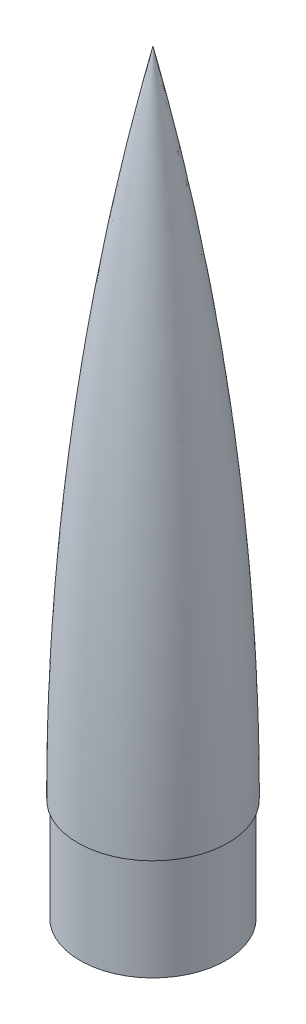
ISO-10303-21;
HEADER;
FILE_DESCRIPTION(('STEP AP214'),'2;1');
FILE_NAME('part.step','',(''),(''),'','','');
FILE_SCHEMA(('AUTOMOTIVE_DESIGN { 1 0 10303 214 1 1 1 1 }'));
ENDSEC;
DATA;
#1=APPLICATION_CONTEXT('core data for automotive mechanical design processes');
#2=APPLICATION_PROTOCOL_DEFINITION('international standard','automotive_design',2000,#1);
#3=PRODUCT_CONTEXT('',#1,'mechanical');
#4=PRODUCT('Part','Part','',(#3));
#5=PRODUCT_RELATED_PRODUCT_CATEGORY('part','',(#4));
#6=PRODUCT_DEFINITION_FORMATION('','',#4);
#7=PRODUCT_DEFINITION_CONTEXT('part definition',#1,'design');
#8=PRODUCT_DEFINITION('design','',#6,#7);
#9=PRODUCT_DEFINITION_SHAPE('','',#8);
#10=(LENGTH_UNIT() NAMED_UNIT(*) SI_UNIT(.MILLI.,.METRE.));
#11=(NAMED_UNIT(*) PLANE_ANGLE_UNIT() SI_UNIT($,.RADIAN.));
#12=(NAMED_UNIT(*) SI_UNIT($,.STERADIAN.) SOLID_ANGLE_UNIT());
#13=UNCERTAINTY_MEASURE_WITH_UNIT(LENGTH_MEASURE(1.E-05),#10,'distance_accuracy_value','');
#14=(GEOMETRIC_REPRESENTATION_CONTEXT(3) GLOBAL_UNCERTAINTY_ASSIGNED_CONTEXT((#13)) GLOBAL_UNIT_ASSIGNED_CONTEXT((#10,
#11,#12)) REPRESENTATION_CONTEXT('',''));
#15=CARTESIAN_POINT('',(0.,0.,0.));
#16=DIRECTION('',(0.,0.,1.));
#17=DIRECTION('',(1.,0.,0.));
#18=AXIS2_PLACEMENT_3D('',#15,#16,#17);
#19=CARTESIAN_POINT('',(0.,0.,0.));
#20=DIRECTION('',(0.,-1.,0.));
#21=DIRECTION('',(1.,0.,0.));
#22=AXIS2_PLACEMENT_3D('',#19,#20,#21);
#23=PLANE('',#22);
#24=CARTESIAN_POINT('',(0.,0.,0.));
#25=DIRECTION('',(0.,1.,0.));
#26=DIRECTION('',(-1.,0.,0.));
#27=AXIS2_PLACEMENT_3D('',#24,#25,#26);
#28=CIRCLE('',#27,26.9875);
#29=CARTESIAN_POINT('',(-26.9875,0.,0.));
#30=VERTEX_POINT('',#29);
#31=EDGE_CURVE('E11',#30,#30,#28,.T.);
#32=ORIENTED_EDGE('',*,*,#31,.F.);
#33=EDGE_LOOP('',(#32));
#34=FACE_BOUND('',#33,.T.);
#35=CARTESIAN_POINT('',(0.,0.,0.));
#36=DIRECTION('',(0.,-1.,0.));
#37=DIRECTION('',(1.,0.,0.));
#38=AXIS2_PLACEMENT_3D('',#35,#36,#37);
#39=CIRCLE('',#38,25.4);
#40=CARTESIAN_POINT('',(25.4,0.,0.));
#41=VERTEX_POINT('',#40);
#42=EDGE_CURVE('E69',#41,#41,#39,.F.);
#43=ORIENTED_EDGE('',*,*,#42,.T.);
#44=EDGE_LOOP('',(#43));
#45=FACE_BOUND('',#44,.T.);
#46=ADVANCED_FACE('F31',(#34,#45),#23,.T.);
#47=CARTESIAN_POINT('',(0.,279.4,0.));
#48=DIRECTION('',(0.,1.,0.));
#49=DIRECTION('',(-1.,0.,0.));
#50=AXIS2_PLACEMENT_3D('',#47,#48,#49);
#51=CYLINDRICAL_SURFACE('',#50,26.9875);
#52=ORIENTED_EDGE('',*,*,#31,.T.);
#53=EDGE_LOOP('',(#52));
#54=FACE_BOUND('',#53,.T.);
#55=CARTESIAN_POINT('',(0.,38.1,0.));
#56=DIRECTION('',(0.,1.,0.));
#57=DIRECTION('',(-1.,0.,0.));
#58=AXIS2_PLACEMENT_3D('',#55,#56,#57);
#59=CIRCLE('',#58,26.9875);
#60=CARTESIAN_POINT('',(-26.9875,38.1,0.));
#61=VERTEX_POINT('',#60);
#62=EDGE_CURVE('E38',#61,#61,#59,.T.);
#63=ORIENTED_EDGE('',*,*,#62,.F.);
#64=EDGE_LOOP('',(#63));
#65=FACE_BOUND('',#64,.T.);
#66=ADVANCED_FACE('F58',(#54,#65),#51,.T.);
#67=CARTESIAN_POINT('',(-26.9875,38.1,0.));
#68=DIRECTION('',(0.,-1.,0.));
#69=DIRECTION('',(1.,0.,0.));
#70=AXIS2_PLACEMENT_3D('',#67,#68,#69);
#71=PLANE('',#70);
#72=ORIENTED_EDGE('',*,*,#62,.T.);
#73=EDGE_LOOP('',(#72));
#74=FACE_BOUND('',#73,.T.);
#75=CARTESIAN_POINT('',(0.,38.1,0.));
#76=DIRECTION('',(0.,1.,0.));
#77=DIRECTION('',(-1.,0.,0.));
#78=AXIS2_PLACEMENT_3D('',#75,#76,#77);
#79=CIRCLE('',#78,27.813);
#80=CARTESIAN_POINT('',(-27.813,38.1,0.));
#81=VERTEX_POINT('',#80);
#82=EDGE_CURVE('E71',#81,#81,#79,.T.);
#83=ORIENTED_EDGE('',*,*,#82,.F.);
#84=EDGE_LOOP('',(#83));
#85=FACE_BOUND('',#84,.T.);
#86=ADVANCED_FACE('F63',(#74,#85),#71,.T.);
#87=CARTESIAN_POINT('',(1032.82865981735,38.1000000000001,0.));
#88=DIRECTION('',(0.,0.,-1.));
#89=DIRECTION('',(-1.,0.,0.));
#90=AXIS2_PLACEMENT_3D('',#87,#88,#89);
#91=CIRCLE('',#90,1060.64165981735);
#92=TRIMMED_CURVE('',#91,(PARAMETER_VALUE(-0.229513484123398)),
(PARAMETER_VALUE(0.229513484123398)),.T.,.PARAMETER.);
#93=CARTESIAN_POINT('',(0.,38.1,0.));
#94=DIRECTION('',(0.,1.,0.));
#95=AXIS1_PLACEMENT('',#93,#94);
#96=SURFACE_OF_REVOLUTION('',#92,#95);
#97=ORIENTED_EDGE('',*,*,#82,.T.);
#98=EDGE_LOOP('',(#97));
#99=FACE_BOUND('',#98,.T.);
#100=CARTESIAN_POINT('',(-2.22044604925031E-13,279.4,0.));
#101=VERTEX_POINT('',#100);
#102=VERTEX_LOOP('',#101);
#103=FACE_BOUND('',#102,.T.);
#104=ADVANCED_FACE('F86',(#99,#103),#96,.T.);
#105=CARTESIAN_POINT('',(0.,279.4,0.));
#106=DIRECTION('',(0.,1.,0.));
#107=DIRECTION('',(-1.,0.,0.));
#108=AXIS2_PLACEMENT_3D('',#105,#106,#107);
#109=CYLINDRICAL_SURFACE('',#108,25.4);
#110=ORIENTED_EDGE('',*,*,#42,.F.);
#111=EDGE_LOOP('',(#110));
#112=FACE_BOUND('',#111,.T.);
#113=CARTESIAN_POINT('',(0.,39.6875,0.));
#114=DIRECTION('',(0.,-1.,0.));
#115=DIRECTION('',(1.,0.,0.));
#116=AXIS2_PLACEMENT_3D('',#113,#114,#115);
#117=CIRCLE('',#116,25.4);
#118=CARTESIAN_POINT('',(25.4,39.6875,0.));
#119=VERTEX_POINT('',#118);
#120=EDGE_CURVE('E72',#119,#119,#117,.F.);
#121=ORIENTED_EDGE('',*,*,#120,.T.);
#122=EDGE_LOOP('',(#121));
#123=FACE_BOUND('',#122,.T.);
#124=ADVANCED_FACE('F52',(#112,#123),#109,.F.);
#125=CARTESIAN_POINT('',(-26.9875,39.6875,0.));
#126=DIRECTION('',(0.,-1.,0.));
#127=DIRECTION('',(1.,0.,0.));
#128=AXIS2_PLACEMENT_3D('',#125,#126,#127);
#129=PLANE('',#128);
#130=ORIENTED_EDGE('',*,*,#120,.F.);
#131=EDGE_LOOP('',(#130));
#132=FACE_BOUND('',#131,.T.);
#133=CARTESIAN_POINT('',(0.,39.6875,0.));
#134=DIRECTION('',(0.,-1.,0.));
#135=DIRECTION('',(1.,0.,0.));
#136=AXIS2_PLACEMENT_3D('',#133,#134,#135);
#137=CIRCLE('',#136,26.2243101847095);
#138=CARTESIAN_POINT('',(26.2243101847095,39.6875,0.));
#139=VERTEX_POINT('',#138);
#140=EDGE_CURVE('E77',#139,#139,#137,.F.);
#141=ORIENTED_EDGE('',*,*,#140,.T.);
#142=EDGE_LOOP('',(#141));
#143=FACE_BOUND('',#142,.T.);
#144=ADVANCED_FACE('F46',(#132,#143),#129,.F.);
#145=CARTESIAN_POINT('',(1032.82865981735,38.1000000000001,0.));
#146=DIRECTION('',(0.,0.,-1.));
#147=DIRECTION('',(-1.,0.,0.));
#148=AXIS2_PLACEMENT_3D('',#145,#146,#147);
#149=CIRCLE('',#148,1059.05415981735);
#150=TRIMMED_CURVE('',#149,(PARAMETER_VALUE(-0.223006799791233)),
(PARAMETER_VALUE(0.223006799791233)),.T.,.PARAMETER.);
#151=CARTESIAN_POINT('',(0.,38.1,0.));
#152=DIRECTION('',(0.,1.,0.));
#153=AXIS1_PLACEMENT('',#151,#152);
#154=SURFACE_OF_REVOLUTION('',#150,#153);
#155=ORIENTED_EDGE('',*,*,#140,.F.);
#156=EDGE_LOOP('',(#155));
#157=FACE_BOUND('',#156,.T.);
#158=CARTESIAN_POINT('',(0.,272.323553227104,0.));
#159=VERTEX_POINT('',#158);
#160=VERTEX_LOOP('',#159);
#161=FACE_BOUND('',#160,.T.);
#162=ADVANCED_FACE('F44',(#157,#161),#154,.F.);
#163=CLOSED_SHELL('',(#46,#66,#86,#104,#124,#144,#162));
#164=MANIFOLD_SOLID_BREP('B2',#163);
#165=ADVANCED_BREP_SHAPE_REPRESENTATION('',(#18,#164),#14);
#166=SHAPE_DEFINITION_REPRESENTATION(#9,#165);
ENDSEC;
END-ISO-10303-21;
